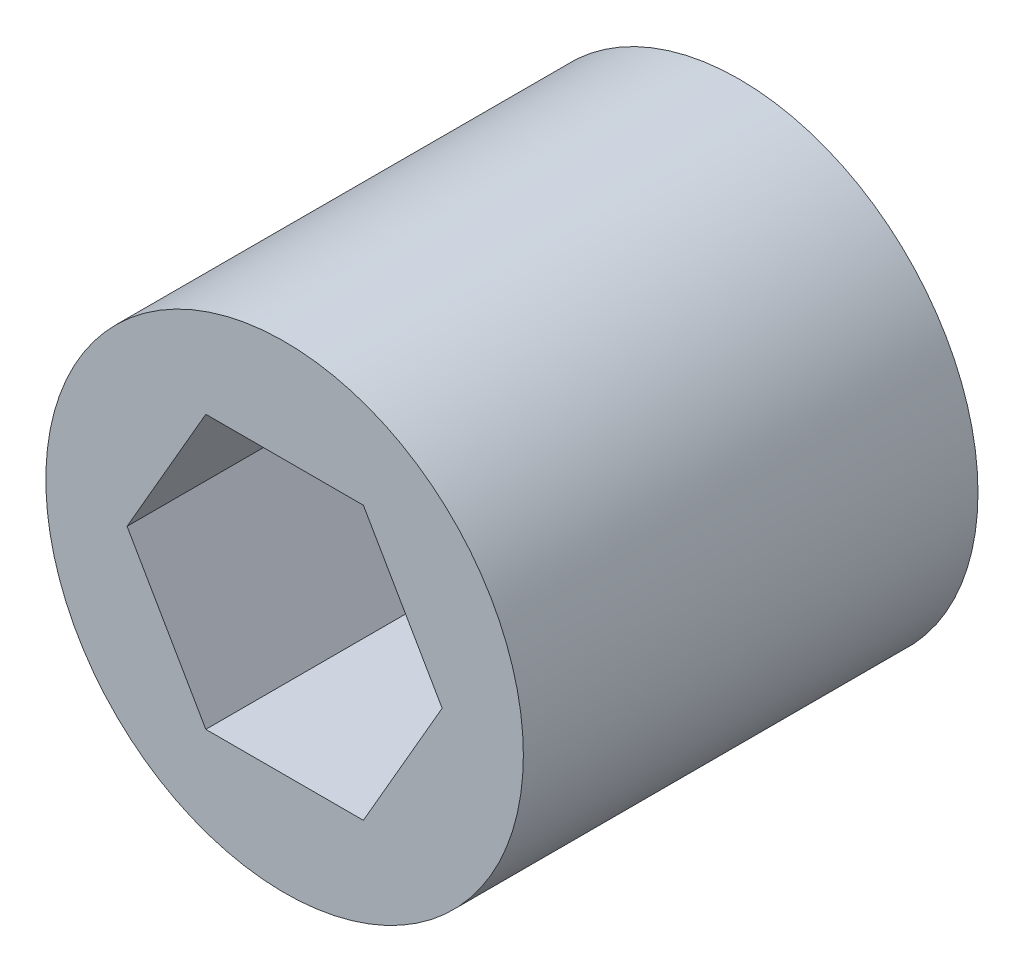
ISO-10303-21;
HEADER;
FILE_DESCRIPTION(('STEP AP214'),'2;1');
FILE_NAME('part.step','',(''),(''),'','','');
FILE_SCHEMA(('AUTOMOTIVE_DESIGN { 1 0 10303 214 1 1 1 1 }'));
ENDSEC;
DATA;
#1=APPLICATION_CONTEXT('core data for automotive mechanical design processes');
#2=APPLICATION_PROTOCOL_DEFINITION('international standard','automotive_design',2000,#1);
#3=PRODUCT_CONTEXT('',#1,'mechanical');
#4=PRODUCT('Part','Part','',(#3));
#5=PRODUCT_RELATED_PRODUCT_CATEGORY('part','',(#4));
#6=PRODUCT_DEFINITION_FORMATION('','',#4);
#7=PRODUCT_DEFINITION_CONTEXT('part definition',#1,'design');
#8=PRODUCT_DEFINITION('design','',#6,#7);
#9=PRODUCT_DEFINITION_SHAPE('','',#8);
#10=(LENGTH_UNIT() NAMED_UNIT(*) SI_UNIT(.MILLI.,.METRE.));
#11=(NAMED_UNIT(*) PLANE_ANGLE_UNIT() SI_UNIT($,.RADIAN.));
#12=(NAMED_UNIT(*) SI_UNIT($,.STERADIAN.) SOLID_ANGLE_UNIT());
#13=UNCERTAINTY_MEASURE_WITH_UNIT(LENGTH_MEASURE(1.E-05),#10,'distance_accuracy_value','');
#14=(GEOMETRIC_REPRESENTATION_CONTEXT(3) GLOBAL_UNCERTAINTY_ASSIGNED_CONTEXT((#13)) GLOBAL_UNIT_ASSIGNED_CONTEXT((#10,
#11,#12)) REPRESENTATION_CONTEXT('',''));
#15=CARTESIAN_POINT('',(0.,0.,0.));
#16=DIRECTION('',(0.,0.,1.));
#17=DIRECTION('',(1.,0.,0.));
#18=AXIS2_PLACEMENT_3D('',#15,#16,#17);
#19=CARTESIAN_POINT('',(0.,0.,-4.));
#20=DIRECTION('',(0.,0.,1.));
#21=DIRECTION('',(1.,0.,0.));
#22=AXIS2_PLACEMENT_3D('',#19,#20,#21);
#23=CYLINDRICAL_SURFACE('',#22,3.5);
#24=CARTESIAN_POINT('',(0.,0.,0.));
#25=DIRECTION('',(0.,0.,1.));
#26=DIRECTION('',(1.,0.,0.));
#27=AXIS2_PLACEMENT_3D('',#24,#25,#26);
#28=CIRCLE('',#27,3.5);
#29=CARTESIAN_POINT('',(3.5,0.,0.));
#30=VERTEX_POINT('',#29);
#31=EDGE_CURVE('E12',#30,#30,#28,.T.);
#32=ORIENTED_EDGE('',*,*,#31,.F.);
#33=EDGE_LOOP('',(#32));
#34=FACE_BOUND('',#33,.T.);
#35=CARTESIAN_POINT('',(0.,0.,-6.6643139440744));
#36=DIRECTION('',(0.,0.,1.));
#37=DIRECTION('',(1.,0.,0.));
#38=AXIS2_PLACEMENT_3D('',#35,#36,#37);
#39=CIRCLE('',#38,3.5);
#40=CARTESIAN_POINT('',(-3.5,0.,-6.6643139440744));
#41=VERTEX_POINT('',#40);
#42=EDGE_CURVE('E117',#41,#41,#39,.T.);
#43=ORIENTED_EDGE('',*,*,#42,.T.);
#44=EDGE_LOOP('',(#43));
#45=FACE_BOUND('',#44,.T.);
#46=ADVANCED_FACE('F31',(#34,#45),#23,.T.);
#47=CARTESIAN_POINT('',(0.,0.,0.));
#48=DIRECTION('',(0.,0.,1.));
#49=DIRECTION('',(1.,0.,0.));
#50=AXIS2_PLACEMENT_3D('',#47,#48,#49);
#51=PLANE('',#50);
#52=DIRECTION('',(-0.5,-0.866025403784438,0.));
#53=VECTOR('',#52,1.);
#54=CARTESIAN_POINT('',(-1.15470053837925,2.,0.));
#55=LINE('',#54,#53);
#56=CARTESIAN_POINT('',(-1.15470053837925,2.,0.));
#57=VERTEX_POINT('',#56);
#58=CARTESIAN_POINT('',(-2.3094010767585,0.,0.));
#59=VERTEX_POINT('',#58);
#60=EDGE_CURVE('E45',#57,#59,#55,.T.);
#61=ORIENTED_EDGE('',*,*,#60,.F.);
#62=DIRECTION('',(-1.,0.,0.));
#63=VECTOR('',#62,1.);
#64=CARTESIAN_POINT('',(1.15470053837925,2.,0.));
#65=LINE('',#64,#63);
#66=CARTESIAN_POINT('',(1.15470053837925,2.,0.));
#67=VERTEX_POINT('',#66);
#68=EDGE_CURVE('E126',#67,#57,#65,.T.);
#69=ORIENTED_EDGE('',*,*,#68,.F.);
#70=DIRECTION('',(-0.5,0.866025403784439,0.));
#71=VECTOR('',#70,1.);
#72=CARTESIAN_POINT('',(2.3094010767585,0.,0.));
#73=LINE('',#72,#71);
#74=CARTESIAN_POINT('',(2.3094010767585,0.,0.));
#75=VERTEX_POINT('',#74);
#76=EDGE_CURVE('E124',#75,#67,#73,.T.);
#77=ORIENTED_EDGE('',*,*,#76,.F.);
#78=DIRECTION('',(0.5,0.866025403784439,0.));
#79=VECTOR('',#78,1.);
#80=CARTESIAN_POINT('',(1.15470053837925,-2.,0.));
#81=LINE('',#80,#79);
#82=CARTESIAN_POINT('',(1.15470053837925,-2.,0.));
#83=VERTEX_POINT('',#82);
#84=EDGE_CURVE('E91',#83,#75,#81,.T.);
#85=ORIENTED_EDGE('',*,*,#84,.F.);
#86=DIRECTION('',(1.,0.,0.));
#87=VECTOR('',#86,1.);
#88=CARTESIAN_POINT('',(-1.15470053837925,-2.,0.));
#89=LINE('',#88,#87);
#90=CARTESIAN_POINT('',(-1.15470053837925,-2.,0.));
#91=VERTEX_POINT('',#90);
#92=EDGE_CURVE('E120',#91,#83,#89,.T.);
#93=ORIENTED_EDGE('',*,*,#92,.F.);
#94=DIRECTION('',(0.5,-0.866025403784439,0.));
#95=VECTOR('',#94,1.);
#96=CARTESIAN_POINT('',(-2.3094010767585,0.,0.));
#97=LINE('',#96,#95);
#98=EDGE_CURVE('E116',#59,#91,#97,.T.);
#99=ORIENTED_EDGE('',*,*,#98,.F.);
#100=EDGE_LOOP('',(#61,#69,#77,#85,#93,#99));
#101=FACE_BOUND('',#100,.T.);
#102=ORIENTED_EDGE('',*,*,#31,.T.);
#103=EDGE_LOOP('',(#102));
#104=FACE_BOUND('',#103,.T.);
#105=ADVANCED_FACE('F140',(#101,#104),#51,.T.);
#106=CARTESIAN_POINT('',(-1.15470053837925,2.,-4.));
#107=DIRECTION('',(-0.866025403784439,0.5,0.));
#108=DIRECTION('',(-0.5,-0.866025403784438,0.));
#109=AXIS2_PLACEMENT_3D('',#106,#107,#108);
#110=PLANE('',#109);
#111=ORIENTED_EDGE('',*,*,#60,.T.);
#112=DIRECTION('',(0.,0.,1.));
#113=VECTOR('',#112,1.);
#114=CARTESIAN_POINT('',(-2.3094010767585,0.,-4.));
#115=LINE('',#114,#113);
#116=CARTESIAN_POINT('',(-2.3094010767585,0.,-4.));
#117=VERTEX_POINT('',#116);
#118=EDGE_CURVE('E75',#117,#59,#115,.T.);
#119=ORIENTED_EDGE('',*,*,#118,.F.);
#120=DIRECTION('',(-0.5,-0.866025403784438,0.));
#121=VECTOR('',#120,1.);
#122=CARTESIAN_POINT('',(-1.15470053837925,2.,-4.));
#123=LINE('',#122,#121);
#124=CARTESIAN_POINT('',(-1.15470053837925,2.,-4.));
#125=VERTEX_POINT('',#124);
#126=EDGE_CURVE('E128',#125,#117,#123,.T.);
#127=ORIENTED_EDGE('',*,*,#126,.F.);
#128=DIRECTION('',(0.,0.,1.));
#129=VECTOR('',#128,1.);
#130=CARTESIAN_POINT('',(-1.15470053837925,2.,-4.));
#131=LINE('',#130,#129);
#132=EDGE_CURVE('E38',#125,#57,#131,.T.);
#133=ORIENTED_EDGE('',*,*,#132,.T.);
#134=EDGE_LOOP('',(#111,#119,#127,#133));
#135=FACE_BOUND('',#134,.T.);
#136=ADVANCED_FACE('F171',(#135),#110,.F.);
#137=CARTESIAN_POINT('',(1.15470053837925,2.,-4.));
#138=DIRECTION('',(0.,1.,0.));
#139=DIRECTION('',(0.,0.,1.));
#140=AXIS2_PLACEMENT_3D('',#137,#138,#139);
#141=PLANE('',#140);
#142=ORIENTED_EDGE('',*,*,#68,.T.);
#143=ORIENTED_EDGE('',*,*,#132,.F.);
#144=DIRECTION('',(-1.,0.,0.));
#145=VECTOR('',#144,1.);
#146=CARTESIAN_POINT('',(1.15470053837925,2.,-4.));
#147=LINE('',#146,#145);
#148=CARTESIAN_POINT('',(1.15470053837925,2.,-4.));
#149=VERTEX_POINT('',#148);
#150=EDGE_CURVE('E103',#149,#125,#147,.T.);
#151=ORIENTED_EDGE('',*,*,#150,.F.);
#152=DIRECTION('',(0.,0.,1.));
#153=VECTOR('',#152,1.);
#154=CARTESIAN_POINT('',(1.15470053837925,2.,-4.));
#155=LINE('',#154,#153);
#156=EDGE_CURVE('E95',#149,#67,#155,.T.);
#157=ORIENTED_EDGE('',*,*,#156,.T.);
#158=EDGE_LOOP('',(#142,#143,#151,#157));
#159=FACE_BOUND('',#158,.T.);
#160=ADVANCED_FACE('F177',(#159),#141,.F.);
#161=CARTESIAN_POINT('',(2.3094010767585,0.,-4.));
#162=DIRECTION('',(0.866025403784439,0.5,0.));
#163=DIRECTION('',(-0.5,0.866025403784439,0.));
#164=AXIS2_PLACEMENT_3D('',#161,#162,#163);
#165=PLANE('',#164);
#166=ORIENTED_EDGE('',*,*,#76,.T.);
#167=ORIENTED_EDGE('',*,*,#156,.F.);
#168=DIRECTION('',(-0.5,0.866025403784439,0.));
#169=VECTOR('',#168,1.);
#170=CARTESIAN_POINT('',(2.3094010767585,0.,-4.));
#171=LINE('',#170,#169);
#172=CARTESIAN_POINT('',(2.3094010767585,0.,-4.));
#173=VERTEX_POINT('',#172);
#174=EDGE_CURVE('E99',#173,#149,#171,.T.);
#175=ORIENTED_EDGE('',*,*,#174,.F.);
#176=DIRECTION('',(0.,0.,1.));
#177=VECTOR('',#176,1.);
#178=CARTESIAN_POINT('',(2.3094010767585,0.,-4.));
#179=LINE('',#178,#177);
#180=EDGE_CURVE('E84',#173,#75,#179,.T.);
#181=ORIENTED_EDGE('',*,*,#180,.T.);
#182=EDGE_LOOP('',(#166,#167,#175,#181));
#183=FACE_BOUND('',#182,.T.);
#184=ADVANCED_FACE('F100',(#183),#165,.F.);
#185=CARTESIAN_POINT('',(1.15470053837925,-2.,-4.));
#186=DIRECTION('',(0.866025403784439,-0.5,0.));
#187=DIRECTION('',(0.5,0.866025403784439,0.));
#188=AXIS2_PLACEMENT_3D('',#185,#186,#187);
#189=PLANE('',#188);
#190=ORIENTED_EDGE('',*,*,#84,.T.);
#191=ORIENTED_EDGE('',*,*,#180,.F.);
#192=DIRECTION('',(0.5,0.866025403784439,0.));
#193=VECTOR('',#192,1.);
#194=CARTESIAN_POINT('',(1.15470053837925,-2.,-4.));
#195=LINE('',#194,#193);
#196=CARTESIAN_POINT('',(1.15470053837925,-2.,-4.));
#197=VERTEX_POINT('',#196);
#198=EDGE_CURVE('E88',#197,#173,#195,.T.);
#199=ORIENTED_EDGE('',*,*,#198,.F.);
#200=DIRECTION('',(0.,0.,1.));
#201=VECTOR('',#200,1.);
#202=CARTESIAN_POINT('',(1.15470053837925,-2.,-4.));
#203=LINE('',#202,#201);
#204=EDGE_CURVE('E96',#197,#83,#203,.T.);
#205=ORIENTED_EDGE('',*,*,#204,.T.);
#206=EDGE_LOOP('',(#190,#191,#199,#205));
#207=FACE_BOUND('',#206,.T.);
#208=ADVANCED_FACE('F86',(#207),#189,.F.);
#209=CARTESIAN_POINT('',(-1.15470053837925,-2.,-4.));
#210=DIRECTION('',(0.,-1.,0.));
#211=DIRECTION('',(1.,0.,0.));
#212=AXIS2_PLACEMENT_3D('',#209,#210,#211);
#213=PLANE('',#212);
#214=ORIENTED_EDGE('',*,*,#92,.T.);
#215=ORIENTED_EDGE('',*,*,#204,.F.);
#216=DIRECTION('',(1.,0.,0.));
#217=VECTOR('',#216,1.);
#218=CARTESIAN_POINT('',(-1.15470053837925,-2.,-4.));
#219=LINE('',#218,#217);
#220=CARTESIAN_POINT('',(-1.15470053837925,-2.,-4.));
#221=VERTEX_POINT('',#220);
#222=EDGE_CURVE('E108',#221,#197,#219,.T.);
#223=ORIENTED_EDGE('',*,*,#222,.F.);
#224=DIRECTION('',(0.,0.,1.));
#225=VECTOR('',#224,1.);
#226=CARTESIAN_POINT('',(-1.15470053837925,-2.,-4.));
#227=LINE('',#226,#225);
#228=EDGE_CURVE('E132',#221,#91,#227,.T.);
#229=ORIENTED_EDGE('',*,*,#228,.T.);
#230=EDGE_LOOP('',(#214,#215,#223,#229));
#231=FACE_BOUND('',#230,.T.);
#232=ADVANCED_FACE('F144',(#231),#213,.F.);
#233=CARTESIAN_POINT('',(-2.3094010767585,0.,-4.));
#234=DIRECTION('',(-0.866025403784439,-0.5,0.));
#235=DIRECTION('',(0.5,-0.866025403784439,0.));
#236=AXIS2_PLACEMENT_3D('',#233,#234,#235);
#237=PLANE('',#236);
#238=ORIENTED_EDGE('',*,*,#98,.T.);
#239=ORIENTED_EDGE('',*,*,#228,.F.);
#240=DIRECTION('',(0.5,-0.866025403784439,0.));
#241=VECTOR('',#240,1.);
#242=CARTESIAN_POINT('',(-2.3094010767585,0.,-4.));
#243=LINE('',#242,#241);
#244=EDGE_CURVE('E110',#117,#221,#243,.T.);
#245=ORIENTED_EDGE('',*,*,#244,.F.);
#246=ORIENTED_EDGE('',*,*,#118,.T.);
#247=EDGE_LOOP('',(#238,#239,#245,#246));
#248=FACE_BOUND('',#247,.T.);
#249=ADVANCED_FACE('F135',(#248),#237,.F.);
#250=CARTESIAN_POINT('',(0.,0.,-4.));
#251=DIRECTION('',(0.,0.,-1.));
#252=DIRECTION('',(-1.,0.,0.));
#253=AXIS2_PLACEMENT_3D('',#250,#251,#252);
#254=PLANE('',#253);
#255=ORIENTED_EDGE('',*,*,#150,.T.);
#256=ORIENTED_EDGE('',*,*,#126,.T.);
#257=ORIENTED_EDGE('',*,*,#244,.T.);
#258=ORIENTED_EDGE('',*,*,#222,.T.);
#259=ORIENTED_EDGE('',*,*,#198,.T.);
#260=ORIENTED_EDGE('',*,*,#174,.T.);
#261=EDGE_LOOP('',(#255,#256,#257,#258,#259,#260));
#262=FACE_BOUND('',#261,.T.);
#263=ADVANCED_FACE('F105',(#262),#254,.F.);
#264=CARTESIAN_POINT('',(0.,0.,-8.));
#265=DIRECTION('',(0.,0.,1.));
#266=DIRECTION('',(-1.,0.,0.));
#267=AXIS2_PLACEMENT_3D('',#264,#265,#266);
#268=CONICAL_SURFACE('',#267,0.5,1.15191730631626);
#269=CARTESIAN_POINT('',(0.,0.,-8.));
#270=DIRECTION('',(0.,0.,-1.));
#271=DIRECTION('',(-1.,0.,0.));
#272=AXIS2_PLACEMENT_3D('',#269,#270,#271);
#273=CIRCLE('',#272,0.5);
#274=CARTESIAN_POINT('',(-0.500000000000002,0.,-8.));
#275=VERTEX_POINT('',#274);
#276=EDGE_CURVE('E149',#275,#275,#273,.T.);
#277=CARTESIAN_POINT('',(-3.5,0.,-6.6643139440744));
#278=CARTESIAN_POINT('',(-3.46875,0.,-6.67822734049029));
#279=CARTESIAN_POINT('',(-3.4375,0.,-6.69214073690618));
#280=CARTESIAN_POINT('',(-3.375,0.,-6.71996752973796));
#281=CARTESIAN_POINT('',(-3.34375,0.,-6.73388092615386));
#282=CARTESIAN_POINT('',(-3.28125,0.,-6.76170771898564));
#283=CARTESIAN_POINT('',(-3.25,0.,-6.77562111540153));
#284=CARTESIAN_POINT('',(-3.1875,0.,-6.80344790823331));
#285=CARTESIAN_POINT('',(-3.15625,0.,-6.81736130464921));
#286=CARTESIAN_POINT('',(-3.09375,0.,-6.84518809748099));
#287=CARTESIAN_POINT('',(-3.0625,0.,-6.85910149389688));
#288=CARTESIAN_POINT('',(-3.,0.,-6.88692828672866));
#289=CARTESIAN_POINT('',(-2.96875,0.,-6.90084168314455));
#290=CARTESIAN_POINT('',(-2.90625,0.,-6.92866847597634));
#291=CARTESIAN_POINT('',(-2.875,0.,-6.94258187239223));
#292=CARTESIAN_POINT('',(-2.8125,0.,-6.97040866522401));
#293=CARTESIAN_POINT('',(-2.78125,0.,-6.98432206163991));
#294=CARTESIAN_POINT('',(-2.71875,0.,-7.01214885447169));
#295=CARTESIAN_POINT('',(-2.6875,0.,-7.02606225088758));
#296=CARTESIAN_POINT('',(-2.625,0.,-7.05388904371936));
#297=CARTESIAN_POINT('',(-2.59375,0.,-7.06780244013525));
#298=CARTESIAN_POINT('',(-2.53125,0.,-7.09562923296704));
#299=CARTESIAN_POINT('',(-2.5,0.,-7.10954262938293));
#300=CARTESIAN_POINT('',(-2.4375,0.,-7.13736942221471));
#301=CARTESIAN_POINT('',(-2.40625,0.,-7.15128281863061));
#302=CARTESIAN_POINT('',(-2.34375,0.,-7.17910961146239));
#303=CARTESIAN_POINT('',(-2.3125,0.,-7.19302300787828));
#304=CARTESIAN_POINT('',(-2.25,0.,-7.22084980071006));
#305=CARTESIAN_POINT('',(-2.21875,0.,-7.23476319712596));
#306=CARTESIAN_POINT('',(-2.15625,0.,-7.26258998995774));
#307=CARTESIAN_POINT('',(-2.125,0.,-7.27650338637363));
#308=CARTESIAN_POINT('',(-2.0625,0.,-7.30433017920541));
#309=CARTESIAN_POINT('',(-2.03125,0.,-7.31824357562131));
#310=CARTESIAN_POINT('',(-1.96875,0.,-7.34607036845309));
#311=CARTESIAN_POINT('',(-1.9375,0.,-7.35998376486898));
#312=CARTESIAN_POINT('',(-1.875,0.,-7.38781055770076));
#313=CARTESIAN_POINT('',(-1.84375,0.,-7.40172395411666));
#314=CARTESIAN_POINT('',(-1.78125,0.,-7.42955074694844));
#315=CARTESIAN_POINT('',(-1.75,0.,-7.44346414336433));
#316=CARTESIAN_POINT('',(-1.6875,0.,-7.47129093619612));
#317=CARTESIAN_POINT('',(-1.65625,0.,-7.48520433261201));
#318=CARTESIAN_POINT('',(-1.59375,0.,-7.51303112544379));
#319=CARTESIAN_POINT('',(-1.5625,0.,-7.52694452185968));
#320=CARTESIAN_POINT('',(-1.5,0.,-7.55477131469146));
#321=CARTESIAN_POINT('',(-1.46875,0.,-7.56868471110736));
#322=CARTESIAN_POINT('',(-1.40625,0.,-7.59651150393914));
#323=CARTESIAN_POINT('',(-1.375,0.,-7.61042490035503));
#324=CARTESIAN_POINT('',(-1.3125,0.,-7.63825169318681));
#325=CARTESIAN_POINT('',(-1.28125,0.,-7.65216508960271));
#326=CARTESIAN_POINT('',(-1.21875,0.,-7.67999188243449));
#327=CARTESIAN_POINT('',(-1.1875,0.,-7.69390527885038));
#328=CARTESIAN_POINT('',(-1.125,0.,-7.72173207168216));
#329=CARTESIAN_POINT('',(-1.09375,0.,-7.73564546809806));
#330=CARTESIAN_POINT('',(-1.03125,0.,-7.76347226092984));
#331=CARTESIAN_POINT('',(-1.,0.,-7.77738565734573));
#332=CARTESIAN_POINT('',(-0.937500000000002,0.,-7.80521245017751));
#333=CARTESIAN_POINT('',(-0.906250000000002,0.,-7.81912584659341));
#334=CARTESIAN_POINT('',(-0.843750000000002,0.,-7.84695263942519));
#335=CARTESIAN_POINT('',(-0.812500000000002,0.,-7.86086603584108));
#336=CARTESIAN_POINT('',(-0.750000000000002,0.,-7.88869282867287));
#337=CARTESIAN_POINT('',(-0.718750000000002,0.,-7.90260622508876));
#338=CARTESIAN_POINT('',(-0.656250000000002,0.,-7.93043301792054));
#339=CARTESIAN_POINT('',(-0.625000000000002,0.,-7.94434641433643));
#340=CARTESIAN_POINT('',(-0.562500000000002,0.,-7.97217320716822));
#341=CARTESIAN_POINT('',(-0.531250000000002,0.,-7.98608660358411));
#342=CARTESIAN_POINT('',(-0.500000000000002,0.,-8.));
#343=B_SPLINE_CURVE_WITH_KNOTS('',3,(#277,#278,#279,#280,#281,#282,#283,#284,#285,#286,#287,
#288,#289,#290,#291,#292,#293,#294,#295,#296,#297,#298,#299,#300,#301,#302,#303,#304,#305,#306,
#307,#308,#309,#310,#311,#312,#313,#314,#315,#316,#317,#318,#319,#320,#321,#322,#323,#324,#325,
#326,#327,#328,#329,#330,#331,#332,#333,#334,#335,#336,#337,#338,#339,#340,#341,#342),
.UNSPECIFIED.,.F.,.F.,(4,2,2,2,2,2,2,2,2,2,2,2,2,2,2,2,2,2,2,2,2,2,2,2,2,2,2,2,2,2,2,2,4),(0.,
0.102622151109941,0.205244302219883,0.307866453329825,0.410488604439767,0.513110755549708,
0.61573290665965,0.718355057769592,0.820977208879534,0.923599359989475,1.02622151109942,
1.12884366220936,1.2314658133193,1.33408796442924,1.43671011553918,1.53933226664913,
1.64195441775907,1.74457656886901,1.84719871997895,1.94982087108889,2.05244302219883,
2.15506517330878,2.25768732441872,2.36030947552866,2.4629316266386,2.56555377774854,
2.66817592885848,2.77079807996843,2.87342023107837,2.97604238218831,3.07866453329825,
3.18128668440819,3.28390883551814),.UNSPECIFIED.);
#344=EDGE_CURVE('BSEAM155',#41,#275,#343,.T.);
#345=ORIENTED_EDGE('',*,*,#42,.F.);
#346=ORIENTED_EDGE('',*,*,#276,.F.);
#347=ORIENTED_EDGE('',*,*,#344,.T.);
#348=ORIENTED_EDGE('',*,*,#344,.F.);
#349=EDGE_LOOP('',(#345,#347,#346,#348));
#350=FACE_BOUND('',#349,.T.);
#351=ADVANCED_FACE('F155',(#350),#268,.T.);
#352=CARTESIAN_POINT('',(0.,0.,-8.));
#353=DIRECTION('',(0.,0.,-1.));
#354=DIRECTION('',(-1.,0.,0.));
#355=AXIS2_PLACEMENT_3D('',#352,#353,#354);
#356=PLANE('',#355);
#357=ORIENTED_EDGE('',*,*,#276,.T.);
#358=EDGE_LOOP('',(#357));
#359=FACE_BOUND('',#358,.T.);
#360=ADVANCED_FACE('F153',(#359),#356,.T.);
#361=CLOSED_SHELL('',(#46,#105,#136,#160,#184,#208,#232,#249,#263,#351,#360));
#362=MANIFOLD_SOLID_BREP('B2',#361);
#363=ADVANCED_BREP_SHAPE_REPRESENTATION('',(#18,#362),#14);
#364=SHAPE_DEFINITION_REPRESENTATION(#9,#363);
ENDSEC;
END-ISO-10303-21;
